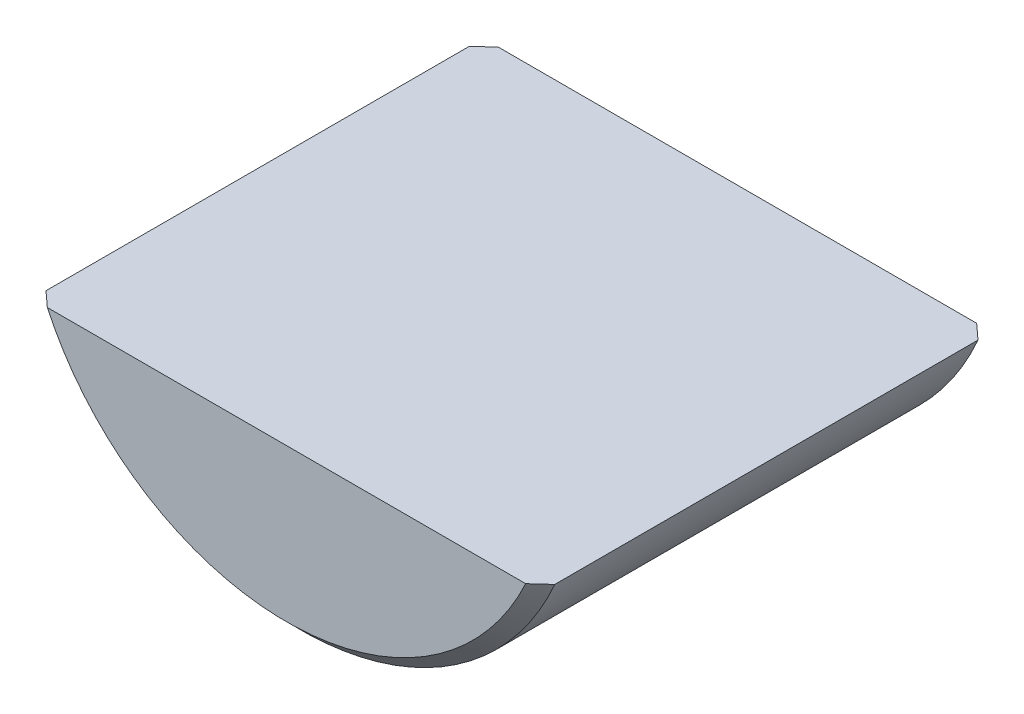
ISO-10303-21;
HEADER;
FILE_DESCRIPTION(('STEP AP214'),'2;1');
FILE_NAME('part.step','',(''),(''),'','','');
FILE_SCHEMA(('AUTOMOTIVE_DESIGN { 1 0 10303 214 1 1 1 1 }'));
ENDSEC;
DATA;
#1=APPLICATION_CONTEXT('core data for automotive mechanical design processes');
#2=APPLICATION_PROTOCOL_DEFINITION('international standard','automotive_design',2000,#1);
#3=PRODUCT_CONTEXT('',#1,'mechanical');
#4=PRODUCT('Part','Part','',(#3));
#5=PRODUCT_RELATED_PRODUCT_CATEGORY('part','',(#4));
#6=PRODUCT_DEFINITION_FORMATION('','',#4);
#7=PRODUCT_DEFINITION_CONTEXT('part definition',#1,'design');
#8=PRODUCT_DEFINITION('design','',#6,#7);
#9=PRODUCT_DEFINITION_SHAPE('','',#8);
#10=(LENGTH_UNIT() NAMED_UNIT(*) SI_UNIT(.MILLI.,.METRE.));
#11=(NAMED_UNIT(*) PLANE_ANGLE_UNIT() SI_UNIT($,.RADIAN.));
#12=(NAMED_UNIT(*) SI_UNIT($,.STERADIAN.) SOLID_ANGLE_UNIT());
#13=UNCERTAINTY_MEASURE_WITH_UNIT(LENGTH_MEASURE(1.E-05),#10,'distance_accuracy_value','');
#14=(GEOMETRIC_REPRESENTATION_CONTEXT(3) GLOBAL_UNCERTAINTY_ASSIGNED_CONTEXT((#13)) GLOBAL_UNIT_ASSIGNED_CONTEXT((#10,
#11,#12)) REPRESENTATION_CONTEXT('',''));
#15=CARTESIAN_POINT('',(0.,0.,0.));
#16=DIRECTION('',(0.,0.,1.));
#17=DIRECTION('',(1.,0.,0.));
#18=AXIS2_PLACEMENT_3D('',#15,#16,#17);
#19=CARTESIAN_POINT('',(0.,0.,3.25));
#20=DIRECTION('',(0.,0.,-1.));
#21=DIRECTION('',(-1.,0.,0.));
#22=AXIS2_PLACEMENT_3D('',#19,#20,#21);
#23=CYLINDRICAL_SURFACE('',#22,4.);
#24=DIRECTION('',(0.,0.,-1.));
#25=VECTOR('',#24,1.);
#26=CARTESIAN_POINT('',(3.66606055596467,-1.6,3.25));
#27=LINE('',#26,#25);
#28=CARTESIAN_POINT('',(3.66606055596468,-1.6,3.05));
#29=VERTEX_POINT('',#28);
#30=CARTESIAN_POINT('',(3.66606055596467,-1.6,-3.05));
#31=VERTEX_POINT('',#30);
#32=EDGE_CURVE('E60',#29,#31,#27,.T.);
#33=ORIENTED_EDGE('',*,*,#32,.F.);
#34=CARTESIAN_POINT('',(0.,0.,3.05));
#35=DIRECTION('',(0.,0.,1.));
#36=DIRECTION('',(1.,0.,0.));
#37=AXIS2_PLACEMENT_3D('',#34,#35,#36);
#38=CIRCLE('',#37,4.);
#39=CARTESIAN_POINT('',(-3.66606055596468,-1.6,3.05));
#40=VERTEX_POINT('',#39);
#41=EDGE_CURVE('E70',#29,#40,#38,.F.);
#42=ORIENTED_EDGE('',*,*,#41,.T.);
#43=DIRECTION('',(0.,0.,-1.));
#44=VECTOR('',#43,1.);
#45=CARTESIAN_POINT('',(-3.66606055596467,-1.6,3.25));
#46=LINE('',#45,#44);
#47=CARTESIAN_POINT('',(-3.66606055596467,-1.6,-3.05));
#48=VERTEX_POINT('',#47);
#49=EDGE_CURVE('E79',#48,#40,#46,.F.);
#50=ORIENTED_EDGE('',*,*,#49,.F.);
#51=CARTESIAN_POINT('',(0.,0.,-3.05));
#52=DIRECTION('',(0.,0.,1.));
#53=DIRECTION('',(1.,0.,0.));
#54=AXIS2_PLACEMENT_3D('',#51,#52,#53);
#55=CIRCLE('',#54,4.);
#56=EDGE_CURVE('E72',#48,#31,#55,.T.);
#57=ORIENTED_EDGE('',*,*,#56,.T.);
#58=EDGE_LOOP('',(#33,#42,#50,#57));
#59=FACE_BOUND('',#58,.T.);
#60=ADVANCED_FACE('F17',(#59),#23,.T.);
#61=CARTESIAN_POINT('',(0.,0.,3.25));
#62=DIRECTION('',(0.,0.,1.));
#63=DIRECTION('',(1.,0.,0.));
#64=AXIS2_PLACEMENT_3D('',#61,#62,#63);
#65=PLANE('',#64);
#66=CARTESIAN_POINT('',(0.,0.,3.25));
#67=DIRECTION('',(0.,0.,1.));
#68=DIRECTION('',(1.,0.,0.));
#69=AXIS2_PLACEMENT_3D('',#66,#67,#68);
#70=CIRCLE('',#69,3.8);
#71=CARTESIAN_POINT('',(-3.44673758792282,-1.6,3.25));
#72=VERTEX_POINT('',#71);
#73=CARTESIAN_POINT('',(3.44673758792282,-1.6,3.25));
#74=VERTEX_POINT('',#73);
#75=EDGE_CURVE('E66',#72,#74,#70,.T.);
#76=ORIENTED_EDGE('',*,*,#75,.T.);
#77=DIRECTION('',(-1.,0.,0.));
#78=VECTOR('',#77,1.);
#79=CARTESIAN_POINT('',(0.,-1.6,3.25));
#80=LINE('',#79,#78);
#81=EDGE_CURVE('E36',#74,#72,#80,.T.);
#82=ORIENTED_EDGE('',*,*,#81,.T.);
#83=EDGE_LOOP('',(#76,#82));
#84=FACE_BOUND('',#83,.T.);
#85=ADVANCED_FACE('F113',(#84),#65,.T.);
#86=CARTESIAN_POINT('',(0.,0.,-3.25));
#87=DIRECTION('',(0.,0.,1.));
#88=DIRECTION('',(1.,0.,0.));
#89=AXIS2_PLACEMENT_3D('',#86,#87,#88);
#90=PLANE('',#89);
#91=DIRECTION('',(-1.,0.,0.));
#92=VECTOR('',#91,1.);
#93=CARTESIAN_POINT('',(0.,-1.6,-3.25));
#94=LINE('',#93,#92);
#95=CARTESIAN_POINT('',(3.44673758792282,-1.6,-3.25));
#96=VERTEX_POINT('',#95);
#97=CARTESIAN_POINT('',(-3.44673758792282,-1.6,-3.25));
#98=VERTEX_POINT('',#97);
#99=EDGE_CURVE('E103',#96,#98,#94,.T.);
#100=ORIENTED_EDGE('',*,*,#99,.F.);
#101=CARTESIAN_POINT('',(0.,0.,-3.25));
#102=DIRECTION('',(0.,0.,1.));
#103=DIRECTION('',(1.,0.,0.));
#104=AXIS2_PLACEMENT_3D('',#101,#102,#103);
#105=CIRCLE('',#104,3.8);
#106=EDGE_CURVE('E77',#96,#98,#105,.F.);
#107=ORIENTED_EDGE('',*,*,#106,.T.);
#108=EDGE_LOOP('',(#100,#107));
#109=FACE_BOUND('',#108,.T.);
#110=ADVANCED_FACE('F109',(#109),#90,.F.);
#111=CARTESIAN_POINT('',(0.,0.,-3.05));
#112=DIRECTION('',(0.,0.,1.));
#113=DIRECTION('',(1.,0.,0.));
#114=AXIS2_PLACEMENT_3D('',#111,#112,#113);
#115=CONICAL_SURFACE('',#114,4.,0.785398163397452);
#116=ORIENTED_EDGE('',*,*,#56,.F.);
#117=CARTESIAN_POINT('',(-6.81326250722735,-1.6,-0.051389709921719));
#118=CARTESIAN_POINT('',(-6.67775761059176,-1.6,-0.183303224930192));
#119=CARTESIAN_POINT('',(-6.5421527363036,-1.6,-0.315114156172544));
#120=CARTESIAN_POINT('',(-6.27069591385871,-1.6,-0.578482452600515));
#121=CARTESIAN_POINT('',(-6.13484396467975,-1.6,-0.710039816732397));
#122=CARTESIAN_POINT('',(-5.72681712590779,-1.6,-1.10428764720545));
#123=CARTESIAN_POINT('',(-5.45420249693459,-1.6,-1.36652338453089));
#124=CARTESIAN_POINT('',(-4.90742804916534,-1.6,-1.88896705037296));
#125=CARTESIAN_POINT('',(-4.63326956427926,-1.6,-2.14917637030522));
#126=CARTESIAN_POINT('',(-4.21989487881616,-1.6,-2.53720709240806));
#127=CARTESIAN_POINT('',(-4.08174922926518,-1.6,-2.66616822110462));
#128=CARTESIAN_POINT('',(-3.80451110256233,-1.6,-2.92306788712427));
#129=CARTESIAN_POINT('',(-3.66541863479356,-1.6,-3.051006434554));
#130=CARTESIAN_POINT('',(-3.42200430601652,-1.6,-3.27266171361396));
#131=CARTESIAN_POINT('',(-3.31796887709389,-1.6,-3.3666926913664));
#132=CARTESIAN_POINT('',(-3.10900633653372,-1.6,-3.55375228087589));
#133=CARTESIAN_POINT('',(-3.00407925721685,-1.6,-3.64678092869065));
#134=CARTESIAN_POINT('',(-2.7930378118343,-1.6,-3.83154509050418));
#135=CARTESIAN_POINT('',(-2.68692312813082,-1.6,-3.92328024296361));
#136=CARTESIAN_POINT('',(-2.52659355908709,-1.6,-4.05953438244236));
#137=CARTESIAN_POINT('',(-2.47295417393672,-1.6,-4.10473035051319));
#138=CARTESIAN_POINT('',(-2.36522341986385,-1.6,-4.19458327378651));
#139=CARTESIAN_POINT('',(-2.31113203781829,-1.6,-4.23924021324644));
#140=CARTESIAN_POINT('',(-2.25678212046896,-1.6,-4.28358254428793));
#141=B_SPLINE_CURVE_WITH_KNOTS('',3,(#117,#118,#119,#120,#121,#122,#123,#124,#125,#126,#127,
#128,#129,#130,#131,#132,#133,#134,#135,#136,#137,#138,#139,#140),.UNSPECIFIED.,.F.,.F.,(4,2,2,
2,2,2,2,2,2,2,2,4),(0.,0.567331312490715,1.13466497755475,2.26946324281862,3.40339784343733,
3.97034826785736,4.53729308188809,4.95798609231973,5.37866391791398,5.7994570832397,
6.00987906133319,6.22030717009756),.UNSPECIFIED.);
#142=EDGE_CURVE('E43',#48,#98,#141,.T.);
#143=ORIENTED_EDGE('',*,*,#142,.T.);
#144=ORIENTED_EDGE('',*,*,#106,.F.);
#145=CARTESIAN_POINT('',(2.25678212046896,-1.6,-4.28358254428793));
#146=CARTESIAN_POINT('',(2.31113203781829,-1.6,-4.23924021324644));
#147=CARTESIAN_POINT('',(2.36522341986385,-1.6,-4.19458327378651));
#148=CARTESIAN_POINT('',(2.47295417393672,-1.6,-4.10473035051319));
#149=CARTESIAN_POINT('',(2.52659355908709,-1.6,-4.05953438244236));
#150=CARTESIAN_POINT('',(2.68692312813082,-1.6,-3.92328024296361));
#151=CARTESIAN_POINT('',(2.7930378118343,-1.6,-3.83154509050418));
#152=CARTESIAN_POINT('',(3.00407925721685,-1.6,-3.64678092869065));
#153=CARTESIAN_POINT('',(3.10900633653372,-1.6,-3.55375228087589));
#154=CARTESIAN_POINT('',(3.31796887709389,-1.6,-3.3666926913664));
#155=CARTESIAN_POINT('',(3.42200430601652,-1.6,-3.27266171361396));
#156=CARTESIAN_POINT('',(3.66541863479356,-1.6,-3.051006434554));
#157=CARTESIAN_POINT('',(3.80451110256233,-1.6,-2.92306788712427));
#158=CARTESIAN_POINT('',(4.08174922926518,-1.6,-2.66616822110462));
#159=CARTESIAN_POINT('',(4.21989487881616,-1.6,-2.53720709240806));
#160=CARTESIAN_POINT('',(4.63326956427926,-1.6,-2.14917637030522));
#161=CARTESIAN_POINT('',(4.90742804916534,-1.6,-1.88896705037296));
#162=CARTESIAN_POINT('',(5.45420249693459,-1.6,-1.3665233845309));
#163=CARTESIAN_POINT('',(5.72681712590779,-1.6,-1.10428764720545));
#164=CARTESIAN_POINT('',(6.13484396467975,-1.6,-0.710039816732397));
#165=CARTESIAN_POINT('',(6.27069591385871,-1.6,-0.578482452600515));
#166=CARTESIAN_POINT('',(6.5421527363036,-1.6,-0.315114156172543));
#167=CARTESIAN_POINT('',(6.67775761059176,-1.6,-0.183303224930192));
#168=CARTESIAN_POINT('',(6.81326250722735,-1.6,-0.051389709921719));
#169=B_SPLINE_CURVE_WITH_KNOTS('',3,(#145,#146,#147,#148,#149,#150,#151,#152,#153,#154,#155,
#156,#157,#158,#159,#160,#161,#162,#163,#164,#165,#166,#167,#168),.UNSPECIFIED.,.F.,.F.,(4,2,2,
2,2,2,2,2,2,2,2,4),(0.,0.21042810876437,0.420850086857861,0.841643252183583,1.26232107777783,
1.68301408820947,2.24995890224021,2.81690932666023,3.95084392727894,5.08564219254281,
5.65297585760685,6.22030717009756),.UNSPECIFIED.);
#170=EDGE_CURVE('E73',#96,#31,#169,.T.);
#171=ORIENTED_EDGE('',*,*,#170,.T.);
#172=EDGE_LOOP('',(#116,#143,#144,#171));
#173=FACE_BOUND('',#172,.T.);
#174=ADVANCED_FACE('F105',(#173),#115,.T.);
#175=CARTESIAN_POINT('',(0.,0.,3.25));
#176=DIRECTION('',(0.,0.,-1.));
#177=DIRECTION('',(-1.,0.,0.));
#178=AXIS2_PLACEMENT_3D('',#175,#176,#177);
#179=CONICAL_SURFACE('',#178,3.8,0.785398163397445);
#180=ORIENTED_EDGE('',*,*,#75,.F.);
#181=CARTESIAN_POINT('',(-2.25678212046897,-1.6,4.28358254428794));
#182=CARTESIAN_POINT('',(-2.3111320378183,-1.6,4.23924021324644));
#183=CARTESIAN_POINT('',(-2.36522341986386,-1.6,4.19458327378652));
#184=CARTESIAN_POINT('',(-2.47295417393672,-1.6,4.10473035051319));
#185=CARTESIAN_POINT('',(-2.5265935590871,-1.6,4.05953438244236));
#186=CARTESIAN_POINT('',(-2.68692312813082,-1.6,3.92328024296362));
#187=CARTESIAN_POINT('',(-2.79303781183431,-1.6,3.83154509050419));
#188=CARTESIAN_POINT('',(-3.00407925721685,-1.6,3.64678092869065));
#189=CARTESIAN_POINT('',(-3.10900633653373,-1.6,3.55375228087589));
#190=CARTESIAN_POINT('',(-3.31796887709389,-1.6,3.3666926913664));
#191=CARTESIAN_POINT('',(-3.42200430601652,-1.6,3.27266171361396));
#192=CARTESIAN_POINT('',(-3.66541863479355,-1.6,3.051006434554));
#193=CARTESIAN_POINT('',(-3.80451110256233,-1.6,2.92306788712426));
#194=CARTESIAN_POINT('',(-4.08174922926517,-1.6,2.66616822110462));
#195=CARTESIAN_POINT('',(-4.21989487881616,-1.6,2.53720709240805));
#196=CARTESIAN_POINT('',(-4.63326956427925,-1.6,2.14917637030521));
#197=CARTESIAN_POINT('',(-4.90742804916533,-1.6,1.88896705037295));
#198=CARTESIAN_POINT('',(-5.45420249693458,-1.6,1.36652338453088));
#199=CARTESIAN_POINT('',(-5.72681712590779,-1.6,1.10428764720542));
#200=CARTESIAN_POINT('',(-6.13484396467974,-1.6,0.710039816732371));
#201=CARTESIAN_POINT('',(-6.2706959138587,-1.6,0.578482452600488));
#202=CARTESIAN_POINT('',(-6.54215273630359,-1.6,0.315114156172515));
#203=CARTESIAN_POINT('',(-6.67775761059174,-1.6,0.183303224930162));
#204=CARTESIAN_POINT('',(-6.81326250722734,-1.6,0.0513897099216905));
#205=B_SPLINE_CURVE_WITH_KNOTS('',3,(#181,#182,#183,#184,#185,#186,#187,#188,#189,#190,#191,
#192,#193,#194,#195,#196,#197,#198,#199,#200,#201,#202,#203,#204),.UNSPECIFIED.,.F.,.F.,(4,2,2,
2,2,2,2,2,2,2,2,4),(0.,0.21042810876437,0.420850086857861,0.841643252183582,1.26232107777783,
1.68301408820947,2.2499589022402,2.81690932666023,3.95084392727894,5.08564219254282,
5.65297585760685,6.22030717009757),.UNSPECIFIED.);
#206=EDGE_CURVE('E11',#72,#40,#205,.T.);
#207=ORIENTED_EDGE('',*,*,#206,.T.);
#208=ORIENTED_EDGE('',*,*,#41,.F.);
#209=CARTESIAN_POINT('',(6.81326250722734,-1.6,0.0513897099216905));
#210=CARTESIAN_POINT('',(6.67775761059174,-1.6,0.183303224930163));
#211=CARTESIAN_POINT('',(6.54215273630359,-1.6,0.315114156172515));
#212=CARTESIAN_POINT('',(6.2706959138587,-1.6,0.578482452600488));
#213=CARTESIAN_POINT('',(6.13484396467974,-1.6,0.710039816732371));
#214=CARTESIAN_POINT('',(5.72681712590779,-1.6,1.10428764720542));
#215=CARTESIAN_POINT('',(5.45420249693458,-1.6,1.36652338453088));
#216=CARTESIAN_POINT('',(4.90742804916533,-1.6,1.88896705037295));
#217=CARTESIAN_POINT('',(4.63326956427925,-1.6,2.14917637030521));
#218=CARTESIAN_POINT('',(4.21989487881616,-1.6,2.53720709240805));
#219=CARTESIAN_POINT('',(4.08174922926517,-1.6,2.66616822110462));
#220=CARTESIAN_POINT('',(3.80451110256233,-1.6,2.92306788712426));
#221=CARTESIAN_POINT('',(3.66541863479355,-1.6,3.051006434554));
#222=CARTESIAN_POINT('',(3.42200430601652,-1.6,3.27266171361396));
#223=CARTESIAN_POINT('',(3.31796887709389,-1.6,3.3666926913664));
#224=CARTESIAN_POINT('',(3.10900633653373,-1.6,3.55375228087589));
#225=CARTESIAN_POINT('',(3.00407925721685,-1.6,3.64678092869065));
#226=CARTESIAN_POINT('',(2.79303781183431,-1.6,3.83154509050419));
#227=CARTESIAN_POINT('',(2.68692312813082,-1.6,3.92328024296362));
#228=CARTESIAN_POINT('',(2.5265935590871,-1.6,4.05953438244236));
#229=CARTESIAN_POINT('',(2.47295417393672,-1.6,4.10473035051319));
#230=CARTESIAN_POINT('',(2.36522341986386,-1.6,4.19458327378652));
#231=CARTESIAN_POINT('',(2.3111320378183,-1.6,4.23924021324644));
#232=CARTESIAN_POINT('',(2.25678212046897,-1.6,4.28358254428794));
#233=B_SPLINE_CURVE_WITH_KNOTS('',3,(#209,#210,#211,#212,#213,#214,#215,#216,#217,#218,#219,
#220,#221,#222,#223,#224,#225,#226,#227,#228,#229,#230,#231,#232),.UNSPECIFIED.,.F.,.F.,(4,2,2,
2,2,2,2,2,2,2,2,4),(0.,0.567331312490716,1.13466497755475,2.26946324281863,3.40339784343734,
3.97034826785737,4.5372930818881,4.95798609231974,5.37866391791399,5.79945708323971,
6.0098790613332,6.22030717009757),.UNSPECIFIED.);
#234=EDGE_CURVE('E29',#29,#74,#233,.T.);
#235=ORIENTED_EDGE('',*,*,#234,.T.);
#236=EDGE_LOOP('',(#180,#207,#208,#235));
#237=FACE_BOUND('',#236,.T.);
#238=ADVANCED_FACE('F75',(#237),#179,.T.);
#239=CARTESIAN_POINT('',(-5.,-1.6,27.4349854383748));
#240=DIRECTION('',(0.,1.,0.));
#241=DIRECTION('',(0.,0.,1.));
#242=AXIS2_PLACEMENT_3D('',#239,#240,#241);
#243=PLANE('',#242);
#244=ORIENTED_EDGE('',*,*,#142,.F.);
#245=ORIENTED_EDGE('',*,*,#49,.T.);
#246=ORIENTED_EDGE('',*,*,#206,.F.);
#247=ORIENTED_EDGE('',*,*,#81,.F.);
#248=ORIENTED_EDGE('',*,*,#234,.F.);
#249=ORIENTED_EDGE('',*,*,#32,.T.);
#250=ORIENTED_EDGE('',*,*,#170,.F.);
#251=ORIENTED_EDGE('',*,*,#99,.T.);
#252=EDGE_LOOP('',(#244,#245,#246,#247,#248,#249,#250,#251));
#253=FACE_BOUND('',#252,.T.);
#254=ADVANCED_FACE('F59',(#253),#243,.T.);
#255=CLOSED_SHELL('',(#60,#85,#110,#174,#238,#254));
#256=MANIFOLD_SOLID_BREP('B1',#255);
#257=ADVANCED_BREP_SHAPE_REPRESENTATION('',(#18,#256),#14);
#258=SHAPE_DEFINITION_REPRESENTATION(#9,#257);
ENDSEC;
END-ISO-10303-21;
